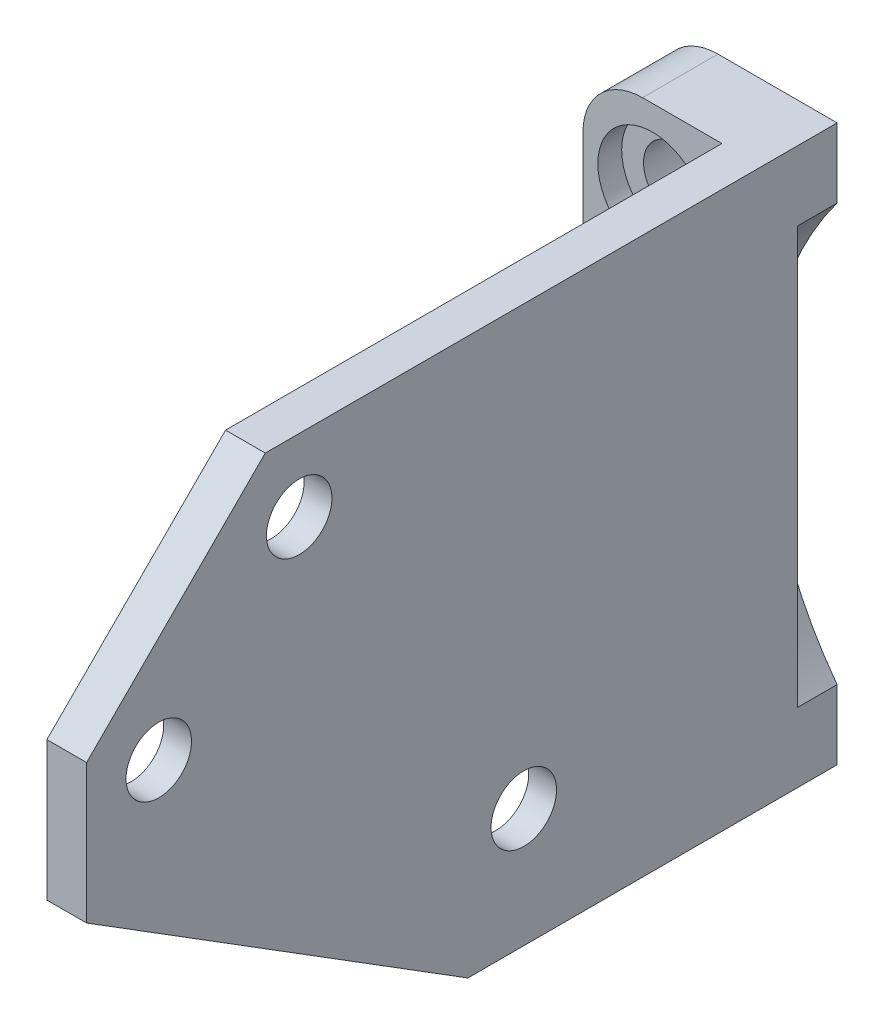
ISO-10303-21;
HEADER;
FILE_DESCRIPTION(('STEP AP214'),'2;1');
FILE_NAME('part.step','',(''),(''),'','','');
FILE_SCHEMA(('AUTOMOTIVE_DESIGN { 1 0 10303 214 1 1 1 1 }'));
ENDSEC;
DATA;
#1=APPLICATION_CONTEXT('core data for automotive mechanical design processes');
#2=APPLICATION_PROTOCOL_DEFINITION('international standard','automotive_design',2000,#1);
#3=PRODUCT_CONTEXT('',#1,'mechanical');
#4=PRODUCT('Part','Part','',(#3));
#5=PRODUCT_RELATED_PRODUCT_CATEGORY('part','',(#4));
#6=PRODUCT_DEFINITION_FORMATION('','',#4);
#7=PRODUCT_DEFINITION_CONTEXT('part definition',#1,'design');
#8=PRODUCT_DEFINITION('design','',#6,#7);
#9=PRODUCT_DEFINITION_SHAPE('','',#8);
#10=(LENGTH_UNIT() NAMED_UNIT(*) SI_UNIT(.MILLI.,.METRE.));
#11=(NAMED_UNIT(*) PLANE_ANGLE_UNIT() SI_UNIT($,.RADIAN.));
#12=(NAMED_UNIT(*) SI_UNIT($,.STERADIAN.) SOLID_ANGLE_UNIT());
#13=UNCERTAINTY_MEASURE_WITH_UNIT(LENGTH_MEASURE(1.E-05),#10,'distance_accuracy_value','');
#14=(GEOMETRIC_REPRESENTATION_CONTEXT(3) GLOBAL_UNCERTAINTY_ASSIGNED_CONTEXT((#13)) GLOBAL_UNIT_ASSIGNED_CONTEXT((#10,
#11,#12)) REPRESENTATION_CONTEXT('',''));
#15=CARTESIAN_POINT('',(0.,0.,0.));
#16=DIRECTION('',(0.,0.,1.));
#17=DIRECTION('',(1.,0.,0.));
#18=AXIS2_PLACEMENT_3D('',#15,#16,#17);
#19=CARTESIAN_POINT('',(0.,0.,0.));
#20=DIRECTION('',(0.,0.,-1.));
#21=DIRECTION('',(-1.,0.,0.));
#22=AXIS2_PLACEMENT_3D('',#19,#20,#21);
#23=PLANE('',#22);
#24=CARTESIAN_POINT('',(-19.5,-10.,0.));
#25=DIRECTION('',(0.,0.,-1.));
#26=DIRECTION('',(-1.,0.,0.));
#27=AXIS2_PLACEMENT_3D('',#24,#25,#26);
#28=CIRCLE('',#27,2.75);
#29=CARTESIAN_POINT('',(-22.25,-10.,0.));
#30=VERTEX_POINT('',#29);
#31=EDGE_CURVE('E200',#30,#30,#28,.T.);
#32=ORIENTED_EDGE('',*,*,#31,.T.);
#33=EDGE_LOOP('',(#32));
#34=FACE_BOUND('',#33,.T.);
#35=DIRECTION('',(0.,1.,0.));
#36=VECTOR('',#35,1.);
#37=CARTESIAN_POINT('',(-16.,-14.,0.));
#38=LINE('',#37,#36);
#39=CARTESIAN_POINT('',(-16.,-14.,0.));
#40=VERTEX_POINT('',#39);
#41=CARTESIAN_POINT('',(-16.,-5.5,0.));
#42=VERTEX_POINT('',#41);
#43=EDGE_CURVE('E211',#40,#42,#38,.T.);
#44=ORIENTED_EDGE('',*,*,#43,.T.);
#45=DIRECTION('',(1.,0.,0.));
#46=VECTOR('',#45,1.);
#47=CARTESIAN_POINT('',(-23.,-5.5,0.));
#48=LINE('',#47,#46);
#49=CARTESIAN_POINT('',(-23.,-5.5,0.));
#50=VERTEX_POINT('',#49);
#51=EDGE_CURVE('E338',#42,#50,#48,.F.);
#52=ORIENTED_EDGE('',*,*,#51,.T.);
#53=DIRECTION('',(0.,-1.,0.));
#54=VECTOR('',#53,1.);
#55=CARTESIAN_POINT('',(-23.,-14.,0.));
#56=LINE('',#55,#54);
#57=CARTESIAN_POINT('',(-23.,-11.,0.));
#58=VERTEX_POINT('',#57);
#59=EDGE_CURVE('E203',#50,#58,#56,.T.);
#60=ORIENTED_EDGE('',*,*,#59,.T.);
#61=CARTESIAN_POINT('',(-20.,-11.,0.));
#62=DIRECTION('',(0.,0.,-1.));
#63=DIRECTION('',(-1.,0.,0.));
#64=AXIS2_PLACEMENT_3D('',#61,#62,#63);
#65=CIRCLE('',#64,3.);
#66=CARTESIAN_POINT('',(-20.,-14.,0.));
#67=VERTEX_POINT('',#66);
#68=EDGE_CURVE('E320',#58,#67,#65,.F.);
#69=ORIENTED_EDGE('',*,*,#68,.T.);
#70=DIRECTION('',(1.,0.,0.));
#71=VECTOR('',#70,1.);
#72=CARTESIAN_POINT('',(-23.,-14.,0.));
#73=LINE('',#72,#71);
#74=EDGE_CURVE('E208',#67,#40,#73,.T.);
#75=ORIENTED_EDGE('',*,*,#74,.T.);
#76=EDGE_LOOP('',(#44,#52,#60,#69,#75));
#77=FACE_BOUND('',#76,.T.);
#78=ADVANCED_FACE('F37',(#34,#77),#23,.F.);
#79=CARTESIAN_POINT('',(-14.,-14.,34.));
#80=DIRECTION('',(0.,1.,0.));
#81=DIRECTION('',(-1.,0.,0.));
#82=AXIS2_PLACEMENT_3D('',#79,#80,#81);
#83=PLANE('',#82);
#84=ORIENTED_EDGE('',*,*,#74,.F.);
#85=DIRECTION('',(0.,0.,-1.));
#86=VECTOR('',#85,1.);
#87=CARTESIAN_POINT('',(-20.,-14.,34.));
#88=LINE('',#87,#86);
#89=CARTESIAN_POINT('',(-20.,-14.,-3.8));
#90=VERTEX_POINT('',#89);
#91=EDGE_CURVE('E305',#67,#90,#88,.T.);
#92=ORIENTED_EDGE('',*,*,#91,.T.);
#93=DIRECTION('',(-1.,0.,0.));
#94=VECTOR('',#93,1.);
#95=CARTESIAN_POINT('',(0.,-14.,-3.8));
#96=LINE('',#95,#94);
#97=CARTESIAN_POINT('',(-14.,-14.,-3.8));
#98=VERTEX_POINT('',#97);
#99=EDGE_CURVE('E222',#98,#90,#96,.T.);
#100=ORIENTED_EDGE('',*,*,#99,.F.);
#101=DIRECTION('',(0.,0.,-1.));
#102=VECTOR('',#101,1.);
#103=CARTESIAN_POINT('',(-14.,-14.,34.));
#104=LINE('',#103,#102);
#105=CARTESIAN_POINT('',(-14.,-14.,14.7959856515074));
#106=VERTEX_POINT('',#105);
#107=EDGE_CURVE('E295',#106,#98,#104,.T.);
#108=ORIENTED_EDGE('',*,*,#107,.F.);
#109=DIRECTION('',(-1.,0.,0.));
#110=VECTOR('',#109,1.);
#111=CARTESIAN_POINT('',(-14.,-14.,14.7959856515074));
#112=LINE('',#111,#110);
#113=CARTESIAN_POINT('',(-16.,-14.,14.7959856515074));
#114=VERTEX_POINT('',#113);
#115=EDGE_CURVE('E237',#106,#114,#112,.T.);
#116=ORIENTED_EDGE('',*,*,#115,.T.);
#117=DIRECTION('',(0.,0.,-1.));
#118=VECTOR('',#117,1.);
#119=CARTESIAN_POINT('',(-16.,-14.,34.));
#120=LINE('',#119,#118);
#121=EDGE_CURVE('E287',#114,#40,#120,.T.);
#122=ORIENTED_EDGE('',*,*,#121,.T.);
#123=EDGE_LOOP('',(#84,#92,#100,#108,#116,#122));
#124=FACE_BOUND('',#123,.T.);
#125=ADVANCED_FACE('F366',(#124),#83,.F.);
#126=CARTESIAN_POINT('',(-14.,14.,34.));
#127=DIRECTION('',(0.,-1.,0.));
#128=DIRECTION('',(1.,0.,0.));
#129=AXIS2_PLACEMENT_3D('',#126,#127,#128);
#130=PLANE('',#129);
#131=DIRECTION('',(1.,0.,0.));
#132=VECTOR('',#131,1.);
#133=CARTESIAN_POINT('',(0.,14.,-3.8));
#134=LINE('',#133,#132);
#135=CARTESIAN_POINT('',(-20.,14.,-3.8));
#136=VERTEX_POINT('',#135);
#137=CARTESIAN_POINT('',(-14.,14.,-3.8));
#138=VERTEX_POINT('',#137);
#139=EDGE_CURVE('E228',#136,#138,#134,.T.);
#140=ORIENTED_EDGE('',*,*,#139,.F.);
#141=DIRECTION('',(0.,0.,-1.));
#142=VECTOR('',#141,1.);
#143=CARTESIAN_POINT('',(-20.,14.,34.));
#144=LINE('',#143,#142);
#145=CARTESIAN_POINT('',(-20.,14.,0.));
#146=VERTEX_POINT('',#145);
#147=EDGE_CURVE('E322',#136,#146,#144,.F.);
#148=ORIENTED_EDGE('',*,*,#147,.T.);
#149=DIRECTION('',(-1.,0.,0.));
#150=VECTOR('',#149,1.);
#151=CARTESIAN_POINT('',(-23.,14.,0.));
#152=LINE('',#151,#150);
#153=CARTESIAN_POINT('',(-16.,14.,0.));
#154=VERTEX_POINT('',#153);
#155=EDGE_CURVE('E214',#154,#146,#152,.T.);
#156=ORIENTED_EDGE('',*,*,#155,.F.);
#157=DIRECTION('',(0.,0.,-1.));
#158=VECTOR('',#157,1.);
#159=CARTESIAN_POINT('',(-16.,14.,34.));
#160=LINE('',#159,#158);
#161=CARTESIAN_POINT('',(-16.,14.,24.9999999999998));
#162=VERTEX_POINT('',#161);
#163=EDGE_CURVE('E284',#162,#154,#160,.T.);
#164=ORIENTED_EDGE('',*,*,#163,.F.);
#165=DIRECTION('',(-1.,0.,0.));
#166=VECTOR('',#165,1.);
#167=CARTESIAN_POINT('',(-14.,14.0000000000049,24.9999999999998));
#168=LINE('',#167,#166);
#169=CARTESIAN_POINT('',(-14.,14.0000000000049,24.9999999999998));
#170=VERTEX_POINT('',#169);
#171=EDGE_CURVE('E245',#170,#162,#168,.T.);
#172=ORIENTED_EDGE('',*,*,#171,.F.);
#173=DIRECTION('',(0.,0.,-1.));
#174=VECTOR('',#173,1.);
#175=CARTESIAN_POINT('',(-14.,14.,34.));
#176=LINE('',#175,#174);
#177=EDGE_CURVE('E292',#170,#138,#176,.T.);
#178=ORIENTED_EDGE('',*,*,#177,.T.);
#179=EDGE_LOOP('',(#140,#148,#156,#164,#172,#178));
#180=FACE_BOUND('',#179,.T.);
#181=ADVANCED_FACE('F383',(#180),#130,.F.);
#182=CARTESIAN_POINT('',(-19.5,-10.,0.));
#183=DIRECTION('',(0.,0.,1.));
#184=DIRECTION('',(1.,0.,0.));
#185=AXIS2_PLACEMENT_3D('',#182,#183,#184);
#186=CYLINDRICAL_SURFACE('',#185,1.65);
#187=CARTESIAN_POINT('',(-19.5,-10.,-1.2));
#188=DIRECTION('',(0.,0.,-1.));
#189=DIRECTION('',(-1.,0.,0.));
#190=AXIS2_PLACEMENT_3D('',#187,#188,#189);
#191=CIRCLE('',#190,1.65);
#192=CARTESIAN_POINT('',(-21.15,-10.,-1.2));
#193=VERTEX_POINT('',#192);
#194=EDGE_CURVE('E196',#193,#193,#191,.F.);
#195=ORIENTED_EDGE('',*,*,#194,.T.);
#196=EDGE_LOOP('',(#195));
#197=FACE_BOUND('',#196,.T.);
#198=CARTESIAN_POINT('',(-19.5,-10.,-3.8));
#199=DIRECTION('',(0.,0.,-1.));
#200=DIRECTION('',(-1.,0.,0.));
#201=AXIS2_PLACEMENT_3D('',#198,#199,#200);
#202=CIRCLE('',#201,1.65);
#203=CARTESIAN_POINT('',(-21.15,-10.,-3.8));
#204=VERTEX_POINT('',#203);
#205=EDGE_CURVE('E230',#204,#204,#202,.F.);
#206=ORIENTED_EDGE('',*,*,#205,.F.);
#207=EDGE_LOOP('',(#206));
#208=FACE_BOUND('',#207,.T.);
#209=ADVANCED_FACE('F460',(#197,#208),#186,.F.);
#210=CARTESIAN_POINT('',(-19.5,10.,0.));
#211=DIRECTION('',(0.,0.,1.));
#212=DIRECTION('',(1.,0.,0.));
#213=AXIS2_PLACEMENT_3D('',#210,#211,#212);
#214=CYLINDRICAL_SURFACE('',#213,1.65);
#215=CARTESIAN_POINT('',(-19.5,10.,-1.2));
#216=DIRECTION('',(0.,0.,-1.));
#217=DIRECTION('',(-1.,0.,0.));
#218=AXIS2_PLACEMENT_3D('',#215,#216,#217);
#219=CIRCLE('',#218,1.65);
#220=CARTESIAN_POINT('',(-21.15,10.,-1.2));
#221=VERTEX_POINT('',#220);
#222=EDGE_CURVE('E193',#221,#221,#219,.F.);
#223=ORIENTED_EDGE('',*,*,#222,.T.);
#224=EDGE_LOOP('',(#223));
#225=FACE_BOUND('',#224,.T.);
#226=CARTESIAN_POINT('',(-19.5,10.,-3.8));
#227=DIRECTION('',(0.,0.,-1.));
#228=DIRECTION('',(-1.,0.,0.));
#229=AXIS2_PLACEMENT_3D('',#226,#227,#228);
#230=CIRCLE('',#229,1.65);
#231=CARTESIAN_POINT('',(-21.15,10.,-3.8));
#232=VERTEX_POINT('',#231);
#233=EDGE_CURVE('E217',#232,#232,#230,.F.);
#234=ORIENTED_EDGE('',*,*,#233,.F.);
#235=EDGE_LOOP('',(#234));
#236=FACE_BOUND('',#235,.T.);
#237=ADVANCED_FACE('F463',(#225,#236),#214,.F.);
#238=CARTESIAN_POINT('',(-14.,3.29360748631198,30.3646752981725));
#239=DIRECTION('',(-1.,0.,0.));
#240=DIRECTION('',(0.,0.,1.));
#241=AXIS2_PLACEMENT_3D('',#238,#239,#240);
#242=CYLINDRICAL_SURFACE('',#241,1.64999999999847);
#243=CARTESIAN_POINT('',(-14.,3.29360748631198,30.3646752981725));
#244=DIRECTION('',(-1.,0.,0.));
#245=DIRECTION('',(0.,0.,1.));
#246=AXIS2_PLACEMENT_3D('',#243,#244,#245);
#247=CIRCLE('',#246,1.64999999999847);
#248=CARTESIAN_POINT('',(-14.,3.29360748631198,32.014675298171));
#249=VERTEX_POINT('',#248);
#250=EDGE_CURVE('E277',#249,#249,#247,.T.);
#251=ORIENTED_EDGE('',*,*,#250,.F.);
#252=EDGE_LOOP('',(#251));
#253=FACE_BOUND('',#252,.T.);
#254=CARTESIAN_POINT('',(-15.4,3.29360748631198,30.3646752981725));
#255=DIRECTION('',(-1.,0.,0.));
#256=DIRECTION('',(0.,0.,1.));
#257=AXIS2_PLACEMENT_3D('',#254,#255,#256);
#258=CIRCLE('',#257,1.64999999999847);
#259=CARTESIAN_POINT('',(-15.4,3.29360748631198,32.014675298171));
#260=VERTEX_POINT('',#259);
#261=EDGE_CURVE('E272',#260,#260,#258,.F.);
#262=ORIENTED_EDGE('',*,*,#261,.F.);
#263=EDGE_LOOP('',(#262));
#264=FACE_BOUND('',#263,.T.);
#265=ADVANCED_FACE('F470',(#253,#264),#242,.F.);
#266=CARTESIAN_POINT('',(-14.,10.3646752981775,23.293607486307));
#267=DIRECTION('',(-1.,0.,0.));
#268=DIRECTION('',(0.,0.,1.));
#269=AXIS2_PLACEMENT_3D('',#266,#267,#268);
#270=CYLINDRICAL_SURFACE('',#269,1.64999999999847);
#271=CARTESIAN_POINT('',(-14.,10.3646752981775,23.293607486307));
#272=DIRECTION('',(-1.,0.,0.));
#273=DIRECTION('',(0.,0.,1.));
#274=AXIS2_PLACEMENT_3D('',#271,#272,#273);
#275=CIRCLE('',#274,1.64999999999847);
#276=CARTESIAN_POINT('',(-14.,10.3646752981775,24.9436074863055));
#277=VERTEX_POINT('',#276);
#278=EDGE_CURVE('E273',#277,#277,#275,.T.);
#279=ORIENTED_EDGE('',*,*,#278,.F.);
#280=EDGE_LOOP('',(#279));
#281=FACE_BOUND('',#280,.T.);
#282=CARTESIAN_POINT('',(-15.4,10.3646752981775,23.293607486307));
#283=DIRECTION('',(-1.,0.,0.));
#284=DIRECTION('',(0.,0.,1.));
#285=AXIS2_PLACEMENT_3D('',#282,#283,#284);
#286=CIRCLE('',#285,1.64999999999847);
#287=CARTESIAN_POINT('',(-15.4,10.3646752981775,24.9436074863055));
#288=VERTEX_POINT('',#287);
#289=EDGE_CURVE('E256',#288,#288,#286,.F.);
#290=ORIENTED_EDGE('',*,*,#289,.F.);
#291=EDGE_LOOP('',(#290));
#292=FACE_BOUND('',#291,.T.);
#293=ADVANCED_FACE('F499',(#281,#292),#270,.F.);
#294=CARTESIAN_POINT('',(-14.,-8.02010101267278,11.9798989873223));
#295=DIRECTION('',(-1.,0.,0.));
#296=DIRECTION('',(0.,0.,1.));
#297=AXIS2_PLACEMENT_3D('',#294,#295,#296);
#298=CYLINDRICAL_SURFACE('',#297,1.64999999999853);
#299=CARTESIAN_POINT('',(-14.,-8.02010101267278,11.9798989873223));
#300=DIRECTION('',(-1.,0.,0.));
#301=DIRECTION('',(0.,0.,1.));
#302=AXIS2_PLACEMENT_3D('',#299,#300,#301);
#303=CIRCLE('',#302,1.64999999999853);
#304=CARTESIAN_POINT('',(-14.,-8.02010101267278,13.6298989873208));
#305=VERTEX_POINT('',#304);
#306=EDGE_CURVE('E276',#305,#305,#303,.T.);
#307=ORIENTED_EDGE('',*,*,#306,.F.);
#308=EDGE_LOOP('',(#307));
#309=FACE_BOUND('',#308,.T.);
#310=CARTESIAN_POINT('',(-15.4,-8.02010101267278,11.9798989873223));
#311=DIRECTION('',(-1.,0.,0.));
#312=DIRECTION('',(0.,0.,1.));
#313=AXIS2_PLACEMENT_3D('',#310,#311,#312);
#314=CIRCLE('',#313,1.64999999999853);
#315=CARTESIAN_POINT('',(-15.4,-8.02010101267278,13.6298989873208));
#316=VERTEX_POINT('',#315);
#317=EDGE_CURVE('E268',#316,#316,#314,.F.);
#318=ORIENTED_EDGE('',*,*,#317,.F.);
#319=EDGE_LOOP('',(#318));
#320=FACE_BOUND('',#319,.T.);
#321=ADVANCED_FACE('F502',(#309,#320),#298,.F.);
#322=CARTESIAN_POINT('',(0.,0.,34.));
#323=DIRECTION('',(0.,0.,1.));
#324=DIRECTION('',(1.,0.,0.));
#325=AXIS2_PLACEMENT_3D('',#322,#323,#324);
#326=PLANE('',#325);
#327=DIRECTION('',(-1.,0.,0.));
#328=VECTOR('',#327,1.);
#329=CARTESIAN_POINT('',(-14.,-2.,34.));
#330=LINE('',#329,#328);
#331=CARTESIAN_POINT('',(-14.,-2.,34.));
#332=VERTEX_POINT('',#331);
#333=CARTESIAN_POINT('',(-16.,-2.,34.));
#334=VERTEX_POINT('',#333);
#335=EDGE_CURVE('E236',#332,#334,#330,.T.);
#336=ORIENTED_EDGE('',*,*,#335,.F.);
#337=DIRECTION('',(0.,1.,0.));
#338=VECTOR('',#337,1.);
#339=CARTESIAN_POINT('',(-14.,14.,34.));
#340=LINE('',#339,#338);
#341=CARTESIAN_POINT('',(-14.,5.00000000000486,33.9999999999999));
#342=VERTEX_POINT('',#341);
#343=EDGE_CURVE('E290',#332,#342,#340,.T.);
#344=ORIENTED_EDGE('',*,*,#343,.T.);
#345=DIRECTION('',(-1.,0.,0.));
#346=VECTOR('',#345,1.);
#347=CARTESIAN_POINT('',(-14.,5.00000000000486,33.9999999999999));
#348=LINE('',#347,#346);
#349=CARTESIAN_POINT('',(-16.,5.00000000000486,33.9999999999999));
#350=VERTEX_POINT('',#349);
#351=EDGE_CURVE('E248',#342,#350,#348,.T.);
#352=ORIENTED_EDGE('',*,*,#351,.T.);
#353=DIRECTION('',(0.,1.,0.));
#354=VECTOR('',#353,1.);
#355=CARTESIAN_POINT('',(-16.,-14.,34.));
#356=LINE('',#355,#354);
#357=EDGE_CURVE('E282',#334,#350,#356,.T.);
#358=ORIENTED_EDGE('',*,*,#357,.F.);
#359=EDGE_LOOP('',(#336,#344,#352,#358));
#360=FACE_BOUND('',#359,.T.);
#361=ADVANCED_FACE('F374',(#360),#326,.T.);
#362=CARTESIAN_POINT('',(-14.,14.,34.));
#363=DIRECTION('',(-1.,0.,0.));
#364=DIRECTION('',(0.,0.,1.));
#365=AXIS2_PLACEMENT_3D('',#362,#363,#364);
#366=PLANE('',#365);
#367=DIRECTION('',(0.,-1.,0.));
#368=VECTOR('',#367,1.);
#369=CARTESIAN_POINT('',(-14.,14.,-1.8));
#370=LINE('',#369,#368);
#371=CARTESIAN_POINT('',(-14.,10.5,-1.8));
#372=VERTEX_POINT('',#371);
#373=CARTESIAN_POINT('',(-14.,-10.5,-1.8));
#374=VERTEX_POINT('',#373);
#375=EDGE_CURVE('E11',#372,#374,#370,.T.);
#376=ORIENTED_EDGE('',*,*,#375,.F.);
#377=DIRECTION('',(0.,0.,-1.));
#378=VECTOR('',#377,1.);
#379=CARTESIAN_POINT('',(-14.,10.5,-1.8));
#380=LINE('',#379,#378);
#381=CARTESIAN_POINT('',(-14.,10.5,-3.8));
#382=VERTEX_POINT('',#381);
#383=EDGE_CURVE('E155',#372,#382,#380,.T.);
#384=ORIENTED_EDGE('',*,*,#383,.T.);
#385=DIRECTION('',(0.,-1.,0.));
#386=VECTOR('',#385,1.);
#387=CARTESIAN_POINT('',(-14.,0.,-3.8));
#388=LINE('',#387,#386);
#389=EDGE_CURVE('E220',#138,#382,#388,.T.);
#390=ORIENTED_EDGE('',*,*,#389,.F.);
#391=ORIENTED_EDGE('',*,*,#177,.F.);
#392=DIRECTION('',(0.,-0.707106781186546,0.707106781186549));
#393=VECTOR('',#392,1.);
#394=CARTESIAN_POINT('',(-14.,5.00000000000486,33.9999999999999));
#395=LINE('',#394,#393);
#396=EDGE_CURVE('E242',#170,#342,#395,.T.);
#397=ORIENTED_EDGE('',*,*,#396,.T.);
#398=ORIENTED_EDGE('',*,*,#343,.F.);
#399=DIRECTION('',(0.,-0.529919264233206,-0.848048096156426));
#400=VECTOR('',#399,1.);
#401=CARTESIAN_POINT('',(-14.,-2.,34.));
#402=LINE('',#401,#400);
#403=EDGE_CURVE('E233',#332,#106,#402,.T.);
#404=ORIENTED_EDGE('',*,*,#403,.T.);
#405=ORIENTED_EDGE('',*,*,#107,.T.);
#406=CARTESIAN_POINT('',(-14.,-10.5,-3.8));
#407=VERTEX_POINT('',#406);
#408=EDGE_CURVE('E172',#407,#98,#388,.T.);
#409=ORIENTED_EDGE('',*,*,#408,.F.);
#410=DIRECTION('',(0.,0.,-1.));
#411=VECTOR('',#410,1.);
#412=CARTESIAN_POINT('',(-14.,-10.5,-1.8));
#413=LINE('',#412,#411);
#414=EDGE_CURVE('E52',#407,#374,#413,.F.);
#415=ORIENTED_EDGE('',*,*,#414,.T.);
#416=EDGE_LOOP('',(#376,#384,#390,#391,#397,#398,#404,#405,#409,#415));
#417=FACE_BOUND('',#416,.T.);
#418=ORIENTED_EDGE('',*,*,#278,.T.);
#419=EDGE_LOOP('',(#418));
#420=FACE_BOUND('',#419,.T.);
#421=ORIENTED_EDGE('',*,*,#250,.T.);
#422=EDGE_LOOP('',(#421));
#423=FACE_BOUND('',#422,.T.);
#424=ORIENTED_EDGE('',*,*,#306,.T.);
#425=EDGE_LOOP('',(#424));
#426=FACE_BOUND('',#425,.T.);
#427=ADVANCED_FACE('F168',(#417,#420,#423,#426),#366,.F.);
#428=CARTESIAN_POINT('',(-23.,14.,34.));
#429=DIRECTION('',(1.,0.,0.));
#430=DIRECTION('',(0.,0.,-1.));
#431=AXIS2_PLACEMENT_3D('',#428,#429,#430);
#432=PLANE('',#431);
#433=DIRECTION('',(0.,1.,0.));
#434=VECTOR('',#433,1.);
#435=CARTESIAN_POINT('',(-23.,0.,-3.8));
#436=LINE('',#435,#434);
#437=CARTESIAN_POINT('',(-23.,-11.,-3.8));
#438=VERTEX_POINT('',#437);
#439=CARTESIAN_POINT('',(-23.,11.,-3.8));
#440=VERTEX_POINT('',#439);
#441=EDGE_CURVE('E225',#438,#440,#436,.T.);
#442=ORIENTED_EDGE('',*,*,#441,.F.);
#443=DIRECTION('',(0.,0.,-1.));
#444=VECTOR('',#443,1.);
#445=CARTESIAN_POINT('',(-23.,-11.,34.));
#446=LINE('',#445,#444);
#447=EDGE_CURVE('E317',#438,#58,#446,.F.);
#448=ORIENTED_EDGE('',*,*,#447,.T.);
#449=ORIENTED_EDGE('',*,*,#59,.F.);
#450=CARTESIAN_POINT('',(-23.,5.5,0.));
#451=VERTEX_POINT('',#450);
#452=EDGE_CURVE('E61',#451,#50,#56,.T.);
#453=ORIENTED_EDGE('',*,*,#452,.F.);
#454=CARTESIAN_POINT('',(-23.,11.,0.));
#455=VERTEX_POINT('',#454);
#456=EDGE_CURVE('E206',#455,#451,#56,.T.);
#457=ORIENTED_EDGE('',*,*,#456,.F.);
#458=DIRECTION('',(0.,0.,-1.));
#459=VECTOR('',#458,1.);
#460=CARTESIAN_POINT('',(-23.,11.,34.));
#461=LINE('',#460,#459);
#462=EDGE_CURVE('E314',#455,#440,#461,.T.);
#463=ORIENTED_EDGE('',*,*,#462,.T.);
#464=EDGE_LOOP('',(#442,#448,#449,#453,#457,#463));
#465=FACE_BOUND('',#464,.T.);
#466=ADVANCED_FACE('F394',(#465),#432,.F.);
#467=CARTESIAN_POINT('',(-16.,-14.,34.));
#468=DIRECTION('',(-1.,0.,0.));
#469=DIRECTION('',(0.,0.,1.));
#470=AXIS2_PLACEMENT_3D('',#467,#468,#469);
#471=PLANE('',#470);
#472=CARTESIAN_POINT('',(-16.,5.5,0.));
#473=VERTEX_POINT('',#472);
#474=EDGE_CURVE('E210',#473,#154,#38,.T.);
#475=ORIENTED_EDGE('',*,*,#474,.F.);
#476=CARTESIAN_POINT('',(-16.,5.5,2.5));
#477=DIRECTION('',(-1.,0.,0.));
#478=DIRECTION('',(0.,0.,1.));
#479=AXIS2_PLACEMENT_3D('',#476,#477,#478);
#480=CIRCLE('',#479,2.5);
#481=CARTESIAN_POINT('',(-16.,3.,2.5));
#482=VERTEX_POINT('',#481);
#483=EDGE_CURVE('E331',#473,#482,#480,.T.);
#484=ORIENTED_EDGE('',*,*,#483,.T.);
#485=DIRECTION('',(0.,0.,-1.));
#486=VECTOR('',#485,1.);
#487=CARTESIAN_POINT('',(-16.,3.,34.));
#488=LINE('',#487,#486);
#489=CARTESIAN_POINT('',(-16.,3.,12.1243556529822));
#490=VERTEX_POINT('',#489);
#491=EDGE_CURVE('E183',#490,#482,#488,.T.);
#492=ORIENTED_EDGE('',*,*,#491,.F.);
#493=DIRECTION('',(0.,-1.,0.));
#494=VECTOR('',#493,1.);
#495=CARTESIAN_POINT('',(-16.,-14.,12.1243556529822));
#496=LINE('',#495,#494);
#497=CARTESIAN_POINT('',(-16.,-3.,12.1243556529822));
#498=VERTEX_POINT('',#497);
#499=EDGE_CURVE('E186',#498,#490,#496,.F.);
#500=ORIENTED_EDGE('',*,*,#499,.F.);
#501=DIRECTION('',(0.,0.,-1.));
#502=VECTOR('',#501,1.);
#503=CARTESIAN_POINT('',(-16.,-3.,34.));
#504=LINE('',#503,#502);
#505=CARTESIAN_POINT('',(-16.,-3.,2.5));
#506=VERTEX_POINT('',#505);
#507=EDGE_CURVE('E178',#498,#506,#504,.T.);
#508=ORIENTED_EDGE('',*,*,#507,.T.);
#509=CARTESIAN_POINT('',(-16.,-5.5,2.5));
#510=DIRECTION('',(-1.,0.,0.));
#511=DIRECTION('',(0.,0.,1.));
#512=AXIS2_PLACEMENT_3D('',#509,#510,#511);
#513=CIRCLE('',#512,2.5);
#514=EDGE_CURVE('E329',#506,#42,#513,.T.);
#515=ORIENTED_EDGE('',*,*,#514,.T.);
#516=ORIENTED_EDGE('',*,*,#43,.F.);
#517=ORIENTED_EDGE('',*,*,#121,.F.);
#518=DIRECTION('',(0.,-0.529919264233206,-0.848048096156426));
#519=VECTOR('',#518,1.);
#520=CARTESIAN_POINT('',(-16.,-5.36977311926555,28.607235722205));
#521=LINE('',#520,#519);
#522=EDGE_CURVE('E297',#334,#114,#521,.T.);
#523=ORIENTED_EDGE('',*,*,#522,.F.);
#524=ORIENTED_EDGE('',*,*,#357,.T.);
#525=DIRECTION('',(0.,-0.707106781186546,0.707106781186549));
#526=VECTOR('',#525,1.);
#527=CARTESIAN_POINT('',(-16.,5.00000000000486,33.9999999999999));
#528=LINE('',#527,#526);
#529=EDGE_CURVE('E240',#162,#350,#528,.T.);
#530=ORIENTED_EDGE('',*,*,#529,.F.);
#531=ORIENTED_EDGE('',*,*,#163,.T.);
#532=EDGE_LOOP('',(#475,#484,#492,#500,#508,#515,#516,#517,#523,#524,#530,#531));
#533=FACE_BOUND('',#532,.T.);
#534=CARTESIAN_POINT('',(-16.,10.3646752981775,23.293607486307));
#535=DIRECTION('',(-1.,0.,0.));
#536=DIRECTION('',(0.,0.,1.));
#537=AXIS2_PLACEMENT_3D('',#534,#535,#536);
#538=CIRCLE('',#537,2.74999999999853);
#539=CARTESIAN_POINT('',(-16.,10.3646752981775,26.0436074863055));
#540=VERTEX_POINT('',#539);
#541=EDGE_CURVE('E257',#540,#540,#538,.T.);
#542=ORIENTED_EDGE('',*,*,#541,.F.);
#543=EDGE_LOOP('',(#542));
#544=FACE_BOUND('',#543,.T.);
#545=CARTESIAN_POINT('',(-16.,3.29360748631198,30.3646752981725));
#546=DIRECTION('',(-1.,0.,0.));
#547=DIRECTION('',(0.,0.,1.));
#548=AXIS2_PLACEMENT_3D('',#545,#546,#547);
#549=CIRCLE('',#548,2.74999999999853);
#550=CARTESIAN_POINT('',(-16.,3.29360748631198,33.114675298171));
#551=VERTEX_POINT('',#550);
#552=EDGE_CURVE('E251',#551,#551,#549,.T.);
#553=ORIENTED_EDGE('',*,*,#552,.F.);
#554=EDGE_LOOP('',(#553));
#555=FACE_BOUND('',#554,.T.);
#556=CARTESIAN_POINT('',(-16.,-8.02010101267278,11.9798989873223));
#557=DIRECTION('',(-1.,0.,0.));
#558=DIRECTION('',(0.,0.,1.));
#559=AXIS2_PLACEMENT_3D('',#556,#557,#558);
#560=CIRCLE('',#559,2.74999999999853);
#561=CARTESIAN_POINT('',(-16.,-8.02010101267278,14.7298989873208));
#562=VERTEX_POINT('',#561);
#563=EDGE_CURVE('E269',#562,#562,#560,.T.);
#564=ORIENTED_EDGE('',*,*,#563,.F.);
#565=EDGE_LOOP('',(#564));
#566=FACE_BOUND('',#565,.T.);
#567=ADVANCED_FACE('F358',(#533,#544,#555,#566),#471,.T.);
#568=CARTESIAN_POINT('',(-15.4,-8.02010101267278,11.9798989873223));
#569=DIRECTION('',(-1.,0.,0.));
#570=DIRECTION('',(0.,0.,1.));
#571=AXIS2_PLACEMENT_3D('',#568,#569,#570);
#572=PLANE('',#571);
#573=CARTESIAN_POINT('',(-15.4,-8.02010101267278,11.9798989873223));
#574=DIRECTION('',(-1.,0.,0.));
#575=DIRECTION('',(0.,0.,1.));
#576=AXIS2_PLACEMENT_3D('',#573,#574,#575);
#577=CIRCLE('',#576,2.74999999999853);
#578=CARTESIAN_POINT('',(-15.4,-8.02010101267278,14.7298989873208));
#579=VERTEX_POINT('',#578);
#580=EDGE_CURVE('E265',#579,#579,#577,.T.);
#581=ORIENTED_EDGE('',*,*,#580,.T.);
#582=EDGE_LOOP('',(#581));
#583=FACE_BOUND('',#582,.T.);
#584=ORIENTED_EDGE('',*,*,#317,.T.);
#585=EDGE_LOOP('',(#584));
#586=FACE_BOUND('',#585,.T.);
#587=ADVANCED_FACE('F492',(#583,#586),#572,.T.);
#588=CARTESIAN_POINT('',(-15.4,-8.02010101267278,11.9798989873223));
#589=DIRECTION('',(-1.,0.,0.));
#590=DIRECTION('',(0.,0.,1.));
#591=AXIS2_PLACEMENT_3D('',#588,#589,#590);
#592=CYLINDRICAL_SURFACE('',#591,2.74999999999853);
#593=ORIENTED_EDGE('',*,*,#580,.F.);
#594=EDGE_LOOP('',(#593));
#595=FACE_BOUND('',#594,.T.);
#596=ORIENTED_EDGE('',*,*,#563,.T.);
#597=EDGE_LOOP('',(#596));
#598=FACE_BOUND('',#597,.T.);
#599=ADVANCED_FACE('F480',(#595,#598),#592,.F.);
#600=CARTESIAN_POINT('',(-15.4,10.3646752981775,23.293607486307));
#601=DIRECTION('',(-1.,0.,0.));
#602=DIRECTION('',(0.,0.,1.));
#603=AXIS2_PLACEMENT_3D('',#600,#601,#602);
#604=PLANE('',#603);
#605=CARTESIAN_POINT('',(-15.4,10.3646752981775,23.293607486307));
#606=DIRECTION('',(-1.,0.,0.));
#607=DIRECTION('',(0.,0.,1.));
#608=AXIS2_PLACEMENT_3D('',#605,#606,#607);
#609=CIRCLE('',#608,2.74999999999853);
#610=CARTESIAN_POINT('',(-15.4,10.3646752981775,26.0436074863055));
#611=VERTEX_POINT('',#610);
#612=EDGE_CURVE('E253',#611,#611,#609,.T.);
#613=ORIENTED_EDGE('',*,*,#612,.T.);
#614=EDGE_LOOP('',(#613));
#615=FACE_BOUND('',#614,.T.);
#616=ORIENTED_EDGE('',*,*,#289,.T.);
#617=EDGE_LOOP('',(#616));
#618=FACE_BOUND('',#617,.T.);
#619=ADVANCED_FACE('F476',(#615,#618),#604,.T.);
#620=CARTESIAN_POINT('',(-15.4,10.3646752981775,23.293607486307));
#621=DIRECTION('',(-1.,0.,0.));
#622=DIRECTION('',(0.,0.,1.));
#623=AXIS2_PLACEMENT_3D('',#620,#621,#622);
#624=CYLINDRICAL_SURFACE('',#623,2.74999999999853);
#625=ORIENTED_EDGE('',*,*,#612,.F.);
#626=EDGE_LOOP('',(#625));
#627=FACE_BOUND('',#626,.T.);
#628=ORIENTED_EDGE('',*,*,#541,.T.);
#629=EDGE_LOOP('',(#628));
#630=FACE_BOUND('',#629,.T.);
#631=ADVANCED_FACE('F479',(#627,#630),#624,.F.);
#632=CARTESIAN_POINT('',(-15.4,3.29360748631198,30.3646752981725));
#633=DIRECTION('',(-1.,0.,0.));
#634=DIRECTION('',(0.,0.,1.));
#635=AXIS2_PLACEMENT_3D('',#632,#633,#634);
#636=PLANE('',#635);
#637=CARTESIAN_POINT('',(-15.4,3.29360748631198,30.3646752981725));
#638=DIRECTION('',(-1.,0.,0.));
#639=DIRECTION('',(0.,0.,1.));
#640=AXIS2_PLACEMENT_3D('',#637,#638,#639);
#641=CIRCLE('',#640,2.74999999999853);
#642=CARTESIAN_POINT('',(-15.4,3.29360748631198,33.114675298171));
#643=VERTEX_POINT('',#642);
#644=EDGE_CURVE('E260',#643,#643,#641,.T.);
#645=ORIENTED_EDGE('',*,*,#644,.T.);
#646=EDGE_LOOP('',(#645));
#647=FACE_BOUND('',#646,.T.);
#648=ORIENTED_EDGE('',*,*,#261,.T.);
#649=EDGE_LOOP('',(#648));
#650=FACE_BOUND('',#649,.T.);
#651=ADVANCED_FACE('F484',(#647,#650),#636,.T.);
#652=CARTESIAN_POINT('',(-15.4,3.29360748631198,30.3646752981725));
#653=DIRECTION('',(-1.,0.,0.));
#654=DIRECTION('',(0.,0.,1.));
#655=AXIS2_PLACEMENT_3D('',#652,#653,#654);
#656=CYLINDRICAL_SURFACE('',#655,2.74999999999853);
#657=ORIENTED_EDGE('',*,*,#644,.F.);
#658=EDGE_LOOP('',(#657));
#659=FACE_BOUND('',#658,.T.);
#660=ORIENTED_EDGE('',*,*,#552,.T.);
#661=EDGE_LOOP('',(#660));
#662=FACE_BOUND('',#661,.T.);
#663=ADVANCED_FACE('F411',(#659,#662),#656,.F.);
#664=CARTESIAN_POINT('',(-14.,5.00000000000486,33.9999999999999));
#665=DIRECTION('',(0.,-0.707106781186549,-0.707106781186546));
#666=DIRECTION('',(0.,0.707106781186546,-0.707106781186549));
#667=AXIS2_PLACEMENT_3D('',#664,#665,#666);
#668=PLANE('',#667);
#669=ORIENTED_EDGE('',*,*,#529,.T.);
#670=ORIENTED_EDGE('',*,*,#351,.F.);
#671=ORIENTED_EDGE('',*,*,#396,.F.);
#672=ORIENTED_EDGE('',*,*,#171,.T.);
#673=EDGE_LOOP('',(#669,#670,#671,#672));
#674=FACE_BOUND('',#673,.T.);
#675=ADVANCED_FACE('F378',(#674),#668,.F.);
#676=CARTESIAN_POINT('',(-14.,-2.,34.));
#677=DIRECTION('',(0.,0.848048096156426,-0.529919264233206));
#678=DIRECTION('',(0.,0.529919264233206,0.848048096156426));
#679=AXIS2_PLACEMENT_3D('',#676,#677,#678);
#680=PLANE('',#679);
#681=ORIENTED_EDGE('',*,*,#522,.T.);
#682=ORIENTED_EDGE('',*,*,#115,.F.);
#683=ORIENTED_EDGE('',*,*,#403,.F.);
#684=ORIENTED_EDGE('',*,*,#335,.T.);
#685=EDGE_LOOP('',(#681,#682,#683,#684));
#686=FACE_BOUND('',#685,.T.);
#687=ADVANCED_FACE('F402',(#686),#680,.F.);
#688=CARTESIAN_POINT('',(0.,0.,-3.8));
#689=DIRECTION('',(0.,0.,-1.));
#690=DIRECTION('',(-1.,0.,0.));
#691=AXIS2_PLACEMENT_3D('',#688,#689,#690);
#692=PLANE('',#691);
#693=CARTESIAN_POINT('',(0.,0.,-3.8));
#694=DIRECTION('',(0.,0.,-1.));
#695=DIRECTION('',(-1.,0.,0.));
#696=AXIS2_PLACEMENT_3D('',#693,#694,#695);
#697=CIRCLE('',#696,17.5);
#698=EDGE_CURVE('E45',#407,#382,#697,.T.);
#699=ORIENTED_EDGE('',*,*,#698,.F.);
#700=ORIENTED_EDGE('',*,*,#408,.T.);
#701=ORIENTED_EDGE('',*,*,#99,.T.);
#702=CARTESIAN_POINT('',(-20.,-11.,-3.8));
#703=DIRECTION('',(0.,0.,-1.));
#704=DIRECTION('',(-1.,0.,0.));
#705=AXIS2_PLACEMENT_3D('',#702,#703,#704);
#706=CIRCLE('',#705,3.);
#707=EDGE_CURVE('E312',#90,#438,#706,.T.);
#708=ORIENTED_EDGE('',*,*,#707,.T.);
#709=ORIENTED_EDGE('',*,*,#441,.T.);
#710=CARTESIAN_POINT('',(-20.,11.,-3.8));
#711=DIRECTION('',(0.,0.,-1.));
#712=DIRECTION('',(-1.,0.,0.));
#713=AXIS2_PLACEMENT_3D('',#710,#711,#712);
#714=CIRCLE('',#713,3.);
#715=EDGE_CURVE('E310',#440,#136,#714,.T.);
#716=ORIENTED_EDGE('',*,*,#715,.T.);
#717=ORIENTED_EDGE('',*,*,#139,.T.);
#718=ORIENTED_EDGE('',*,*,#389,.T.);
#719=EDGE_LOOP('',(#699,#700,#701,#708,#709,#716,#717,#718));
#720=FACE_BOUND('',#719,.T.);
#721=ORIENTED_EDGE('',*,*,#233,.T.);
#722=EDGE_LOOP('',(#721));
#723=FACE_BOUND('',#722,.T.);
#724=ORIENTED_EDGE('',*,*,#205,.T.);
#725=EDGE_LOOP('',(#724));
#726=FACE_BOUND('',#725,.T.);
#727=ADVANCED_FACE('F397',(#720,#723,#726),#692,.T.);
#728=CARTESIAN_POINT('',(-19.5,10.,0.));
#729=DIRECTION('',(0.,0.,-1.));
#730=DIRECTION('',(-1.,0.,0.));
#731=AXIS2_PLACEMENT_3D('',#728,#729,#730);
#732=CIRCLE('',#731,2.75);
#733=CARTESIAN_POINT('',(-22.25,10.,0.));
#734=VERTEX_POINT('',#733);
#735=EDGE_CURVE('E190',#734,#734,#732,.T.);
#736=ORIENTED_EDGE('',*,*,#735,.T.);
#737=EDGE_LOOP('',(#736));
#738=FACE_BOUND('',#737,.T.);
#739=ORIENTED_EDGE('',*,*,#456,.T.);
#740=DIRECTION('',(1.,0.,0.));
#741=VECTOR('',#740,1.);
#742=CARTESIAN_POINT('',(0.,5.5,0.));
#743=LINE('',#742,#741);
#744=EDGE_CURVE('E326',#451,#473,#743,.T.);
#745=ORIENTED_EDGE('',*,*,#744,.T.);
#746=ORIENTED_EDGE('',*,*,#474,.T.);
#747=ORIENTED_EDGE('',*,*,#155,.T.);
#748=CARTESIAN_POINT('',(-20.,11.,0.));
#749=DIRECTION('',(0.,0.,-1.));
#750=DIRECTION('',(-1.,0.,0.));
#751=AXIS2_PLACEMENT_3D('',#748,#749,#750);
#752=CIRCLE('',#751,3.);
#753=EDGE_CURVE('E324',#146,#455,#752,.F.);
#754=ORIENTED_EDGE('',*,*,#753,.T.);
#755=EDGE_LOOP('',(#739,#745,#746,#747,#754));
#756=FACE_BOUND('',#755,.T.);
#757=ADVANCED_FACE('F389',(#738,#756),#23,.F.);
#758=CARTESIAN_POINT('',(-19.5,-10.,-1.2));
#759=DIRECTION('',(0.,0.,1.));
#760=DIRECTION('',(1.,0.,0.));
#761=AXIS2_PLACEMENT_3D('',#758,#759,#760);
#762=CYLINDRICAL_SURFACE('',#761,2.75);
#763=CARTESIAN_POINT('',(-19.5,-10.,-1.2));
#764=DIRECTION('',(0.,0.,-1.));
#765=DIRECTION('',(-1.,0.,0.));
#766=AXIS2_PLACEMENT_3D('',#763,#764,#765);
#767=CIRCLE('',#766,2.75);
#768=CARTESIAN_POINT('',(-22.25,-10.,-1.2));
#769=VERTEX_POINT('',#768);
#770=EDGE_CURVE('E199',#769,#769,#767,.T.);
#771=ORIENTED_EDGE('',*,*,#770,.T.);
#772=EDGE_LOOP('',(#771));
#773=FACE_BOUND('',#772,.T.);
#774=ORIENTED_EDGE('',*,*,#31,.F.);
#775=EDGE_LOOP('',(#774));
#776=FACE_BOUND('',#775,.T.);
#777=ADVANCED_FACE('F424',(#773,#776),#762,.F.);
#778=CARTESIAN_POINT('',(0.,0.,-1.2));
#779=DIRECTION('',(0.,0.,-1.));
#780=DIRECTION('',(-1.,0.,0.));
#781=AXIS2_PLACEMENT_3D('',#778,#779,#780);
#782=PLANE('',#781);
#783=ORIENTED_EDGE('',*,*,#194,.F.);
#784=EDGE_LOOP('',(#783));
#785=FACE_BOUND('',#784,.T.);
#786=ORIENTED_EDGE('',*,*,#770,.F.);
#787=EDGE_LOOP('',(#786));
#788=FACE_BOUND('',#787,.T.);
#789=ADVANCED_FACE('F431',(#785,#788),#782,.F.);
#790=CARTESIAN_POINT('',(-19.5,10.,-1.2));
#791=DIRECTION('',(0.,0.,-1.));
#792=DIRECTION('',(-1.,0.,0.));
#793=AXIS2_PLACEMENT_3D('',#790,#791,#792);
#794=PLANE('',#793);
#795=CARTESIAN_POINT('',(-19.5,10.,-1.2));
#796=DIRECTION('',(0.,0.,-1.));
#797=DIRECTION('',(-1.,0.,0.));
#798=AXIS2_PLACEMENT_3D('',#795,#796,#797);
#799=CIRCLE('',#798,2.75);
#800=CARTESIAN_POINT('',(-22.25,10.,-1.2));
#801=VERTEX_POINT('',#800);
#802=EDGE_CURVE('E189',#801,#801,#799,.T.);
#803=ORIENTED_EDGE('',*,*,#802,.F.);
#804=EDGE_LOOP('',(#803));
#805=FACE_BOUND('',#804,.T.);
#806=ORIENTED_EDGE('',*,*,#222,.F.);
#807=EDGE_LOOP('',(#806));
#808=FACE_BOUND('',#807,.T.);
#809=ADVANCED_FACE('F437',(#805,#808),#794,.F.);
#810=CARTESIAN_POINT('',(-19.5,10.,-1.2));
#811=DIRECTION('',(0.,0.,1.));
#812=DIRECTION('',(1.,0.,0.));
#813=AXIS2_PLACEMENT_3D('',#810,#811,#812);
#814=CYLINDRICAL_SURFACE('',#813,2.75);
#815=ORIENTED_EDGE('',*,*,#802,.T.);
#816=EDGE_LOOP('',(#815));
#817=FACE_BOUND('',#816,.T.);
#818=ORIENTED_EDGE('',*,*,#735,.F.);
#819=EDGE_LOOP('',(#818));
#820=FACE_BOUND('',#819,.T.);
#821=ADVANCED_FACE('F435',(#817,#820),#814,.F.);
#822=CARTESIAN_POINT('',(-16.,0.,12.1243556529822));
#823=DIRECTION('',(0.86602540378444,0.,-0.499999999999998));
#824=DIRECTION('',(-0.499999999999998,0.,-0.86602540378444));
#825=AXIS2_PLACEMENT_3D('',#822,#823,#824);
#826=PLANE('',#825);
#827=DIRECTION('',(-0.499999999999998,0.,-0.86602540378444));
#828=VECTOR('',#827,1.);
#829=CARTESIAN_POINT('',(-16.,-3.,12.1243556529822));
#830=LINE('',#829,#828);
#831=CARTESIAN_POINT('',(-21.5566243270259,-3.,2.5));
#832=VERTEX_POINT('',#831);
#833=EDGE_CURVE('E163',#498,#832,#830,.T.);
#834=ORIENTED_EDGE('',*,*,#833,.F.);
#835=ORIENTED_EDGE('',*,*,#499,.T.);
#836=DIRECTION('',(-0.499999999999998,0.,-0.86602540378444));
#837=VECTOR('',#836,1.);
#838=CARTESIAN_POINT('',(-16.,3.,12.1243556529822));
#839=LINE('',#838,#837);
#840=CARTESIAN_POINT('',(-21.5566243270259,3.,2.5));
#841=VERTEX_POINT('',#840);
#842=EDGE_CURVE('E175',#490,#841,#839,.T.);
#843=ORIENTED_EDGE('',*,*,#842,.T.);
#844=CARTESIAN_POINT('',(-21.5566243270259,5.5,2.5));
#845=DIRECTION('',(0.86602540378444,0.,-0.499999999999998));
#846=DIRECTION('',(0.499999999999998,0.,0.86602540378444));
#847=AXIS2_PLACEMENT_3D('',#844,#845,#846);
#848=ELLIPSE('',#847,2.88675134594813,2.5);
#849=EDGE_CURVE('E341',#841,#451,#848,.T.);
#850=ORIENTED_EDGE('',*,*,#849,.T.);
#851=ORIENTED_EDGE('',*,*,#452,.T.);
#852=CARTESIAN_POINT('',(-21.5566243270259,-5.5,2.5));
#853=DIRECTION('',(0.86602540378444,0.,-0.499999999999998));
#854=DIRECTION('',(-0.499999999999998,0.,-0.86602540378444));
#855=AXIS2_PLACEMENT_3D('',#852,#853,#854);
#856=ELLIPSE('',#855,2.88675134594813,2.5);
#857=EDGE_CURVE('E344',#50,#832,#856,.T.);
#858=ORIENTED_EDGE('',*,*,#857,.T.);
#859=EDGE_LOOP('',(#834,#835,#843,#850,#851,#858));
#860=FACE_BOUND('',#859,.T.);
#861=ADVANCED_FACE('F348',(#860),#826,.F.);
#862=CARTESIAN_POINT('',(-18.5,3.,15.1));
#863=DIRECTION('',(0.,1.,0.));
#864=DIRECTION('',(0.,0.,1.));
#865=AXIS2_PLACEMENT_3D('',#862,#863,#864);
#866=PLANE('',#865);
#867=ORIENTED_EDGE('',*,*,#491,.T.);
#868=DIRECTION('',(1.,0.,0.));
#869=VECTOR('',#868,1.);
#870=CARTESIAN_POINT('',(-18.5,3.,2.5));
#871=LINE('',#870,#869);
#872=EDGE_CURVE('E333',#482,#841,#871,.F.);
#873=ORIENTED_EDGE('',*,*,#872,.T.);
#874=ORIENTED_EDGE('',*,*,#842,.F.);
#875=EDGE_LOOP('',(#867,#873,#874));
#876=FACE_BOUND('',#875,.T.);
#877=ADVANCED_FACE('F444',(#876),#866,.T.);
#878=CARTESIAN_POINT('',(-18.5,-3.,15.1));
#879=DIRECTION('',(0.,1.,0.));
#880=DIRECTION('',(0.,0.,1.));
#881=AXIS2_PLACEMENT_3D('',#878,#879,#880);
#882=PLANE('',#881);
#883=ORIENTED_EDGE('',*,*,#833,.T.);
#884=DIRECTION('',(1.,0.,0.));
#885=VECTOR('',#884,1.);
#886=CARTESIAN_POINT('',(-16.,-3.,2.5));
#887=LINE('',#886,#885);
#888=EDGE_CURVE('E335',#832,#506,#887,.T.);
#889=ORIENTED_EDGE('',*,*,#888,.T.);
#890=ORIENTED_EDGE('',*,*,#507,.F.);
#891=EDGE_LOOP('',(#883,#889,#890));
#892=FACE_BOUND('',#891,.T.);
#893=ADVANCED_FACE('F354',(#892),#882,.F.);
#894=CARTESIAN_POINT('',(-20.,-11.,34.));
#895=DIRECTION('',(0.,0.,-1.));
#896=DIRECTION('',(-1.,0.,0.));
#897=AXIS2_PLACEMENT_3D('',#894,#895,#896);
#898=CYLINDRICAL_SURFACE('',#897,3.);
#899=ORIENTED_EDGE('',*,*,#68,.F.);
#900=ORIENTED_EDGE('',*,*,#447,.F.);
#901=ORIENTED_EDGE('',*,*,#707,.F.);
#902=ORIENTED_EDGE('',*,*,#91,.F.);
#903=EDGE_LOOP('',(#899,#900,#901,#902));
#904=FACE_BOUND('',#903,.T.);
#905=ADVANCED_FACE('F401',(#904),#898,.T.);
#906=CARTESIAN_POINT('',(-20.,11.,34.));
#907=DIRECTION('',(0.,0.,-1.));
#908=DIRECTION('',(-1.,0.,0.));
#909=AXIS2_PLACEMENT_3D('',#906,#907,#908);
#910=CYLINDRICAL_SURFACE('',#909,3.);
#911=ORIENTED_EDGE('',*,*,#753,.F.);
#912=ORIENTED_EDGE('',*,*,#147,.F.);
#913=ORIENTED_EDGE('',*,*,#715,.F.);
#914=ORIENTED_EDGE('',*,*,#462,.F.);
#915=EDGE_LOOP('',(#911,#912,#913,#914));
#916=FACE_BOUND('',#915,.T.);
#917=ADVANCED_FACE('F392',(#916),#910,.T.);
#918=CARTESIAN_POINT('',(0.,5.5,2.5));
#919=DIRECTION('',(1.,0.,0.));
#920=DIRECTION('',(0.,0.,-1.));
#921=AXIS2_PLACEMENT_3D('',#918,#919,#920);
#922=CYLINDRICAL_SURFACE('',#921,2.5);
#923=ORIENTED_EDGE('',*,*,#849,.F.);
#924=ORIENTED_EDGE('',*,*,#872,.F.);
#925=ORIENTED_EDGE('',*,*,#483,.F.);
#926=ORIENTED_EDGE('',*,*,#744,.F.);
#927=EDGE_LOOP('',(#923,#924,#925,#926));
#928=FACE_BOUND('',#927,.T.);
#929=ADVANCED_FACE('F519',(#928),#922,.F.);
#930=CARTESIAN_POINT('',(-18.5,-5.5,2.5));
#931=DIRECTION('',(-1.,0.,0.));
#932=DIRECTION('',(0.,0.,1.));
#933=AXIS2_PLACEMENT_3D('',#930,#931,#932);
#934=CYLINDRICAL_SURFACE('',#933,2.5);
#935=ORIENTED_EDGE('',*,*,#857,.F.);
#936=ORIENTED_EDGE('',*,*,#51,.F.);
#937=ORIENTED_EDGE('',*,*,#514,.F.);
#938=ORIENTED_EDGE('',*,*,#888,.F.);
#939=EDGE_LOOP('',(#935,#936,#937,#938));
#940=FACE_BOUND('',#939,.T.);
#941=ADVANCED_FACE('F39',(#940),#934,.F.);
#942=CARTESIAN_POINT('',(0.,0.,-1.8));
#943=DIRECTION('',(0.,0.,-1.));
#944=DIRECTION('',(-1.,0.,0.));
#945=AXIS2_PLACEMENT_3D('',#942,#943,#944);
#946=PLANE('',#945);
#947=ORIENTED_EDGE('',*,*,#375,.T.);
#948=CARTESIAN_POINT('',(0.,0.,-1.8));
#949=DIRECTION('',(0.,0.,-1.));
#950=DIRECTION('',(-1.,0.,0.));
#951=AXIS2_PLACEMENT_3D('',#948,#949,#950);
#952=CIRCLE('',#951,17.5);
#953=EDGE_CURVE('E158',#374,#372,#952,.T.);
#954=ORIENTED_EDGE('',*,*,#953,.T.);
#955=EDGE_LOOP('',(#947,#954));
#956=FACE_BOUND('',#955,.T.);
#957=ADVANCED_FACE('F166',(#956),#946,.T.);
#958=CARTESIAN_POINT('',(0.,0.,-1.8));
#959=DIRECTION('',(0.,0.,-1.));
#960=DIRECTION('',(-1.,0.,0.));
#961=AXIS2_PLACEMENT_3D('',#958,#959,#960);
#962=CYLINDRICAL_SURFACE('',#961,17.5);
#963=ORIENTED_EDGE('',*,*,#953,.F.);
#964=ORIENTED_EDGE('',*,*,#414,.F.);
#965=ORIENTED_EDGE('',*,*,#698,.T.);
#966=ORIENTED_EDGE('',*,*,#383,.F.);
#967=EDGE_LOOP('',(#963,#964,#965,#966));
#968=FACE_BOUND('',#967,.T.);
#969=ADVANCED_FACE('F157',(#968),#962,.F.);
#970=CLOSED_SHELL('',(#78,#125,#181,#209,#237,#265,#293,#321,#361,#427,#466,#567,#587,#599,#619,
#631,#651,#663,#675,#687,#727,#757,#777,#789,#809,#821,#861,#877,#893,#905,#917,#929,#941,#957,#969));
#971=MANIFOLD_SOLID_BREP('B2',#970);
#972=ADVANCED_BREP_SHAPE_REPRESENTATION('',(#18,#971),#14);
#973=SHAPE_DEFINITION_REPRESENTATION(#9,#972);
ENDSEC;
END-ISO-10303-21;
